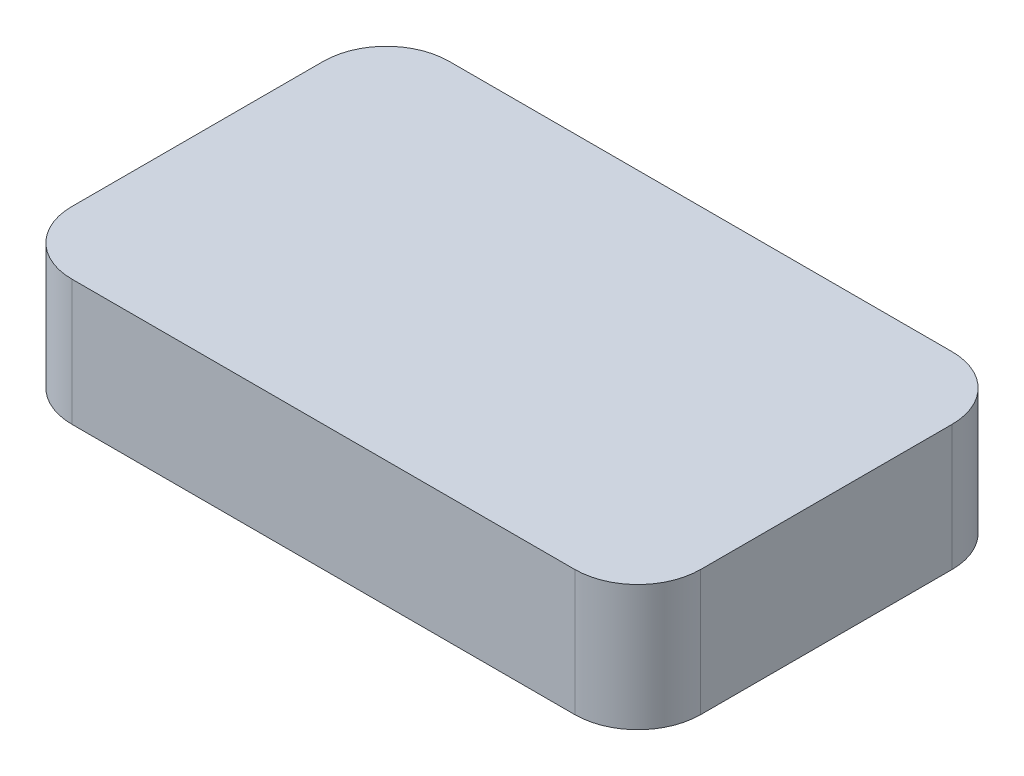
ISO-10303-21;
HEADER;
FILE_DESCRIPTION(('STEP AP214'),'2;1');
FILE_NAME('part.step','',(''),(''),'','','');
FILE_SCHEMA(('AUTOMOTIVE_DESIGN { 1 0 10303 214 1 1 1 1 }'));
ENDSEC;
DATA;
#1=APPLICATION_CONTEXT('core data for automotive mechanical design processes');
#2=APPLICATION_PROTOCOL_DEFINITION('international standard','automotive_design',2000,#1);
#3=PRODUCT_CONTEXT('',#1,'mechanical');
#4=PRODUCT('Part','Part','',(#3));
#5=PRODUCT_RELATED_PRODUCT_CATEGORY('part','',(#4));
#6=PRODUCT_DEFINITION_FORMATION('','',#4);
#7=PRODUCT_DEFINITION_CONTEXT('part definition',#1,'design');
#8=PRODUCT_DEFINITION('design','',#6,#7);
#9=PRODUCT_DEFINITION_SHAPE('','',#8);
#10=(LENGTH_UNIT() NAMED_UNIT(*) SI_UNIT(.MILLI.,.METRE.));
#11=(NAMED_UNIT(*) PLANE_ANGLE_UNIT() SI_UNIT($,.RADIAN.));
#12=(NAMED_UNIT(*) SI_UNIT($,.STERADIAN.) SOLID_ANGLE_UNIT());
#13=UNCERTAINTY_MEASURE_WITH_UNIT(LENGTH_MEASURE(1.E-05),#10,'distance_accuracy_value','');
#14=(GEOMETRIC_REPRESENTATION_CONTEXT(3) GLOBAL_UNCERTAINTY_ASSIGNED_CONTEXT((#13)) GLOBAL_UNIT_ASSIGNED_CONTEXT((#10,
#11,#12)) REPRESENTATION_CONTEXT('',''));
#15=CARTESIAN_POINT('',(0.,0.,0.));
#16=DIRECTION('',(0.,0.,1.));
#17=DIRECTION('',(1.,0.,0.));
#18=AXIS2_PLACEMENT_3D('',#15,#16,#17);
#19=CARTESIAN_POINT('',(25.,10.,15.));
#20=DIRECTION('',(-1.,0.,0.));
#21=DIRECTION('',(0.,0.,1.));
#22=AXIS2_PLACEMENT_3D('',#19,#20,#21);
#23=PLANE('',#22);
#24=DIRECTION('',(0.,0.,-1.));
#25=VECTOR('',#24,1.);
#26=CARTESIAN_POINT('',(25.,0.,15.));
#27=LINE('',#26,#25);
#28=CARTESIAN_POINT('',(25.,0.,10.));
#29=VERTEX_POINT('',#28);
#30=CARTESIAN_POINT('',(25.,0.,-10.));
#31=VERTEX_POINT('',#30);
#32=EDGE_CURVE('E128',#29,#31,#27,.T.);
#33=ORIENTED_EDGE('',*,*,#32,.T.);
#34=DIRECTION('',(0.,-1.,0.));
#35=VECTOR('',#34,1.);
#36=CARTESIAN_POINT('',(25.,10.,-10.));
#37=LINE('',#36,#35);
#38=CARTESIAN_POINT('',(25.,10.,-10.));
#39=VERTEX_POINT('',#38);
#40=EDGE_CURVE('E105',#31,#39,#37,.F.);
#41=ORIENTED_EDGE('',*,*,#40,.T.);
#42=DIRECTION('',(0.,0.,-1.));
#43=VECTOR('',#42,1.);
#44=CARTESIAN_POINT('',(25.,10.,15.));
#45=LINE('',#44,#43);
#46=CARTESIAN_POINT('',(25.,10.,10.));
#47=VERTEX_POINT('',#46);
#48=EDGE_CURVE('E137',#47,#39,#45,.T.);
#49=ORIENTED_EDGE('',*,*,#48,.F.);
#50=DIRECTION('',(0.,-1.,0.));
#51=VECTOR('',#50,1.);
#52=CARTESIAN_POINT('',(25.,10.,10.));
#53=LINE('',#52,#51);
#54=EDGE_CURVE('E110',#47,#29,#53,.T.);
#55=ORIENTED_EDGE('',*,*,#54,.T.);
#56=EDGE_LOOP('',(#33,#41,#49,#55));
#57=FACE_BOUND('',#56,.T.);
#58=ADVANCED_FACE('F33',(#57),#23,.F.);
#59=CARTESIAN_POINT('',(-25.,10.,-15.));
#60=DIRECTION('',(0.,0.,1.));
#61=DIRECTION('',(1.,0.,0.));
#62=AXIS2_PLACEMENT_3D('',#59,#60,#61);
#63=PLANE('',#62);
#64=DIRECTION('',(-1.,0.,0.));
#65=VECTOR('',#64,1.);
#66=CARTESIAN_POINT('',(-25.,10.,-15.));
#67=LINE('',#66,#65);
#68=CARTESIAN_POINT('',(20.,10.,-15.));
#69=VERTEX_POINT('',#68);
#70=CARTESIAN_POINT('',(-20.,10.,-15.));
#71=VERTEX_POINT('',#70);
#72=EDGE_CURVE('E120',#69,#71,#67,.T.);
#73=ORIENTED_EDGE('',*,*,#72,.F.);
#74=DIRECTION('',(0.,-1.,0.));
#75=VECTOR('',#74,1.);
#76=CARTESIAN_POINT('',(20.,10.,-15.));
#77=LINE('',#76,#75);
#78=CARTESIAN_POINT('',(20.,0.,-15.));
#79=VERTEX_POINT('',#78);
#80=EDGE_CURVE('E104',#69,#79,#77,.T.);
#81=ORIENTED_EDGE('',*,*,#80,.T.);
#82=DIRECTION('',(-1.,0.,0.));
#83=VECTOR('',#82,1.);
#84=CARTESIAN_POINT('',(-25.,0.,-15.));
#85=LINE('',#84,#83);
#86=CARTESIAN_POINT('',(-20.,0.,-15.));
#87=VERTEX_POINT('',#86);
#88=EDGE_CURVE('E117',#79,#87,#85,.T.);
#89=ORIENTED_EDGE('',*,*,#88,.T.);
#90=DIRECTION('',(0.,-1.,0.));
#91=VECTOR('',#90,1.);
#92=CARTESIAN_POINT('',(-20.,10.,-15.));
#93=LINE('',#92,#91);
#94=EDGE_CURVE('E122',#87,#71,#93,.F.);
#95=ORIENTED_EDGE('',*,*,#94,.T.);
#96=EDGE_LOOP('',(#73,#81,#89,#95));
#97=FACE_BOUND('',#96,.T.);
#98=ADVANCED_FACE('F116',(#97),#63,.F.);
#99=CARTESIAN_POINT('',(-25.,10.,15.));
#100=DIRECTION('',(1.,0.,0.));
#101=DIRECTION('',(0.,0.,-1.));
#102=AXIS2_PLACEMENT_3D('',#99,#100,#101);
#103=PLANE('',#102);
#104=DIRECTION('',(0.,0.,1.));
#105=VECTOR('',#104,1.);
#106=CARTESIAN_POINT('',(-25.,10.,15.));
#107=LINE('',#106,#105);
#108=CARTESIAN_POINT('',(-25.,10.,-10.));
#109=VERTEX_POINT('',#108);
#110=CARTESIAN_POINT('',(-25.,10.,10.));
#111=VERTEX_POINT('',#110);
#112=EDGE_CURVE('E160',#109,#111,#107,.T.);
#113=ORIENTED_EDGE('',*,*,#112,.F.);
#114=DIRECTION('',(0.,-1.,0.));
#115=VECTOR('',#114,1.);
#116=CARTESIAN_POINT('',(-25.,10.,-10.));
#117=LINE('',#116,#115);
#118=CARTESIAN_POINT('',(-25.,0.,-10.));
#119=VERTEX_POINT('',#118);
#120=EDGE_CURVE('E11',#109,#119,#117,.T.);
#121=ORIENTED_EDGE('',*,*,#120,.T.);
#122=DIRECTION('',(0.,0.,1.));
#123=VECTOR('',#122,1.);
#124=CARTESIAN_POINT('',(-25.,0.,15.));
#125=LINE('',#124,#123);
#126=CARTESIAN_POINT('',(-25.,0.,10.));
#127=VERTEX_POINT('',#126);
#128=EDGE_CURVE('E127',#119,#127,#125,.T.);
#129=ORIENTED_EDGE('',*,*,#128,.T.);
#130=DIRECTION('',(0.,-1.,0.));
#131=VECTOR('',#130,1.);
#132=CARTESIAN_POINT('',(-25.,10.,10.));
#133=LINE('',#132,#131);
#134=EDGE_CURVE('E41',#127,#111,#133,.F.);
#135=ORIENTED_EDGE('',*,*,#134,.T.);
#136=EDGE_LOOP('',(#113,#121,#129,#135));
#137=FACE_BOUND('',#136,.T.);
#138=ADVANCED_FACE('F159',(#137),#103,.F.);
#139=CARTESIAN_POINT('',(-25.,10.,15.));
#140=DIRECTION('',(0.,0.,-1.));
#141=DIRECTION('',(-1.,0.,0.));
#142=AXIS2_PLACEMENT_3D('',#139,#140,#141);
#143=PLANE('',#142);
#144=DIRECTION('',(1.,0.,0.));
#145=VECTOR('',#144,1.);
#146=CARTESIAN_POINT('',(-25.,0.,15.));
#147=LINE('',#146,#145);
#148=CARTESIAN_POINT('',(-20.,0.,15.));
#149=VERTEX_POINT('',#148);
#150=CARTESIAN_POINT('',(20.,0.,15.));
#151=VERTEX_POINT('',#150);
#152=EDGE_CURVE('E131',#149,#151,#147,.T.);
#153=ORIENTED_EDGE('',*,*,#152,.T.);
#154=DIRECTION('',(0.,-1.,0.));
#155=VECTOR('',#154,1.);
#156=CARTESIAN_POINT('',(20.,10.,15.));
#157=LINE('',#156,#155);
#158=CARTESIAN_POINT('',(20.,10.,15.));
#159=VERTEX_POINT('',#158);
#160=EDGE_CURVE('E48',#151,#159,#157,.F.);
#161=ORIENTED_EDGE('',*,*,#160,.T.);
#162=DIRECTION('',(1.,0.,0.));
#163=VECTOR('',#162,1.);
#164=CARTESIAN_POINT('',(-25.,10.,15.));
#165=LINE('',#164,#163);
#166=CARTESIAN_POINT('',(-20.,10.,15.));
#167=VERTEX_POINT('',#166);
#168=EDGE_CURVE('E138',#167,#159,#165,.T.);
#169=ORIENTED_EDGE('',*,*,#168,.F.);
#170=DIRECTION('',(0.,-1.,0.));
#171=VECTOR('',#170,1.);
#172=CARTESIAN_POINT('',(-20.,10.,15.));
#173=LINE('',#172,#171);
#174=EDGE_CURVE('E153',#167,#149,#173,.T.);
#175=ORIENTED_EDGE('',*,*,#174,.T.);
#176=EDGE_LOOP('',(#153,#161,#169,#175));
#177=FACE_BOUND('',#176,.T.);
#178=ADVANCED_FACE('F169',(#177),#143,.F.);
#179=CARTESIAN_POINT('',(0.,10.,0.));
#180=DIRECTION('',(0.,-1.,0.));
#181=DIRECTION('',(0.,0.,-1.));
#182=AXIS2_PLACEMENT_3D('',#179,#180,#181);
#183=PLANE('',#182);
#184=ORIENTED_EDGE('',*,*,#48,.T.);
#185=CARTESIAN_POINT('',(20.,10.,-10.));
#186=DIRECTION('',(0.,-1.,0.));
#187=DIRECTION('',(0.,0.,-1.));
#188=AXIS2_PLACEMENT_3D('',#185,#186,#187);
#189=CIRCLE('',#188,5.);
#190=EDGE_CURVE('E151',#39,#69,#189,.F.);
#191=ORIENTED_EDGE('',*,*,#190,.T.);
#192=ORIENTED_EDGE('',*,*,#72,.T.);
#193=CARTESIAN_POINT('',(-20.,10.,-10.));
#194=DIRECTION('',(0.,-1.,0.));
#195=DIRECTION('',(0.,0.,-1.));
#196=AXIS2_PLACEMENT_3D('',#193,#194,#195);
#197=CIRCLE('',#196,5.);
#198=EDGE_CURVE('E147',#71,#109,#197,.F.);
#199=ORIENTED_EDGE('',*,*,#198,.T.);
#200=ORIENTED_EDGE('',*,*,#112,.T.);
#201=CARTESIAN_POINT('',(-20.,10.,10.));
#202=DIRECTION('',(0.,-1.,0.));
#203=DIRECTION('',(0.,0.,-1.));
#204=AXIS2_PLACEMENT_3D('',#201,#202,#203);
#205=CIRCLE('',#204,5.);
#206=EDGE_CURVE('E55',#111,#167,#205,.F.);
#207=ORIENTED_EDGE('',*,*,#206,.T.);
#208=ORIENTED_EDGE('',*,*,#168,.T.);
#209=CARTESIAN_POINT('',(20.,10.,10.));
#210=DIRECTION('',(0.,-1.,0.));
#211=DIRECTION('',(0.,0.,-1.));
#212=AXIS2_PLACEMENT_3D('',#209,#210,#211);
#213=CIRCLE('',#212,5.);
#214=EDGE_CURVE('E149',#159,#47,#213,.F.);
#215=ORIENTED_EDGE('',*,*,#214,.T.);
#216=EDGE_LOOP('',(#184,#191,#192,#199,#200,#207,#208,#215));
#217=FACE_BOUND('',#216,.T.);
#218=ADVANCED_FACE('F164',(#217),#183,.F.);
#219=CARTESIAN_POINT('',(0.,0.,0.));
#220=DIRECTION('',(0.,-1.,0.));
#221=DIRECTION('',(0.,0.,-1.));
#222=AXIS2_PLACEMENT_3D('',#219,#220,#221);
#223=PLANE('',#222);
#224=ORIENTED_EDGE('',*,*,#88,.F.);
#225=CARTESIAN_POINT('',(20.,0.,-10.));
#226=DIRECTION('',(0.,-1.,0.));
#227=DIRECTION('',(0.,0.,-1.));
#228=AXIS2_PLACEMENT_3D('',#225,#226,#227);
#229=CIRCLE('',#228,5.);
#230=EDGE_CURVE('E100',#79,#31,#229,.T.);
#231=ORIENTED_EDGE('',*,*,#230,.T.);
#232=ORIENTED_EDGE('',*,*,#32,.F.);
#233=CARTESIAN_POINT('',(20.,0.,10.));
#234=DIRECTION('',(0.,-1.,0.));
#235=DIRECTION('',(0.,0.,-1.));
#236=AXIS2_PLACEMENT_3D('',#233,#234,#235);
#237=CIRCLE('',#236,5.);
#238=EDGE_CURVE('E111',#29,#151,#237,.T.);
#239=ORIENTED_EDGE('',*,*,#238,.T.);
#240=ORIENTED_EDGE('',*,*,#152,.F.);
#241=CARTESIAN_POINT('',(-20.,0.,10.));
#242=DIRECTION('',(0.,-1.,0.));
#243=DIRECTION('',(0.,0.,-1.));
#244=AXIS2_PLACEMENT_3D('',#241,#242,#243);
#245=CIRCLE('',#244,5.);
#246=EDGE_CURVE('E121',#149,#127,#245,.T.);
#247=ORIENTED_EDGE('',*,*,#246,.T.);
#248=ORIENTED_EDGE('',*,*,#128,.F.);
#249=CARTESIAN_POINT('',(-20.,0.,-10.));
#250=DIRECTION('',(0.,-1.,0.));
#251=DIRECTION('',(0.,0.,-1.));
#252=AXIS2_PLACEMENT_3D('',#249,#250,#251);
#253=CIRCLE('',#252,5.);
#254=EDGE_CURVE('E126',#119,#87,#253,.T.);
#255=ORIENTED_EDGE('',*,*,#254,.T.);
#256=EDGE_LOOP('',(#224,#231,#232,#239,#240,#247,#248,#255));
#257=FACE_BOUND('',#256,.T.);
#258=ADVANCED_FACE('F124',(#257),#223,.T.);
#259=CARTESIAN_POINT('',(20.,10.,-10.));
#260=DIRECTION('',(0.,-1.,0.));
#261=DIRECTION('',(0.,0.,-1.));
#262=AXIS2_PLACEMENT_3D('',#259,#260,#261);
#263=CYLINDRICAL_SURFACE('',#262,5.);
#264=ORIENTED_EDGE('',*,*,#190,.F.);
#265=ORIENTED_EDGE('',*,*,#40,.F.);
#266=ORIENTED_EDGE('',*,*,#230,.F.);
#267=ORIENTED_EDGE('',*,*,#80,.F.);
#268=EDGE_LOOP('',(#264,#265,#266,#267));
#269=FACE_BOUND('',#268,.T.);
#270=ADVANCED_FACE('F103',(#269),#263,.T.);
#271=CARTESIAN_POINT('',(20.,10.,10.));
#272=DIRECTION('',(0.,-1.,0.));
#273=DIRECTION('',(0.,0.,-1.));
#274=AXIS2_PLACEMENT_3D('',#271,#272,#273);
#275=CYLINDRICAL_SURFACE('',#274,5.);
#276=ORIENTED_EDGE('',*,*,#214,.F.);
#277=ORIENTED_EDGE('',*,*,#160,.F.);
#278=ORIENTED_EDGE('',*,*,#238,.F.);
#279=ORIENTED_EDGE('',*,*,#54,.F.);
#280=EDGE_LOOP('',(#276,#277,#278,#279));
#281=FACE_BOUND('',#280,.T.);
#282=ADVANCED_FACE('F173',(#281),#275,.T.);
#283=CARTESIAN_POINT('',(-20.,10.,-10.));
#284=DIRECTION('',(0.,-1.,0.));
#285=DIRECTION('',(0.,0.,-1.));
#286=AXIS2_PLACEMENT_3D('',#283,#284,#285);
#287=CYLINDRICAL_SURFACE('',#286,5.);
#288=ORIENTED_EDGE('',*,*,#198,.F.);
#289=ORIENTED_EDGE('',*,*,#94,.F.);
#290=ORIENTED_EDGE('',*,*,#254,.F.);
#291=ORIENTED_EDGE('',*,*,#120,.F.);
#292=EDGE_LOOP('',(#288,#289,#290,#291));
#293=FACE_BOUND('',#292,.T.);
#294=ADVANCED_FACE('F179',(#293),#287,.T.);
#295=CARTESIAN_POINT('',(-20.,10.,10.));
#296=DIRECTION('',(0.,-1.,0.));
#297=DIRECTION('',(0.,0.,-1.));
#298=AXIS2_PLACEMENT_3D('',#295,#296,#297);
#299=CYLINDRICAL_SURFACE('',#298,5.);
#300=ORIENTED_EDGE('',*,*,#206,.F.);
#301=ORIENTED_EDGE('',*,*,#134,.F.);
#302=ORIENTED_EDGE('',*,*,#246,.F.);
#303=ORIENTED_EDGE('',*,*,#174,.F.);
#304=EDGE_LOOP('',(#300,#301,#302,#303));
#305=FACE_BOUND('',#304,.T.);
#306=ADVANCED_FACE('F35',(#305),#299,.T.);
#307=CLOSED_SHELL('',(#58,#98,#138,#178,#218,#258,#270,#282,#294,#306));
#308=MANIFOLD_SOLID_BREP('B2',#307);
#309=ADVANCED_BREP_SHAPE_REPRESENTATION('',(#18,#308),#14);
#310=SHAPE_DEFINITION_REPRESENTATION(#9,#309);
ENDSEC;
END-ISO-10303-21;
